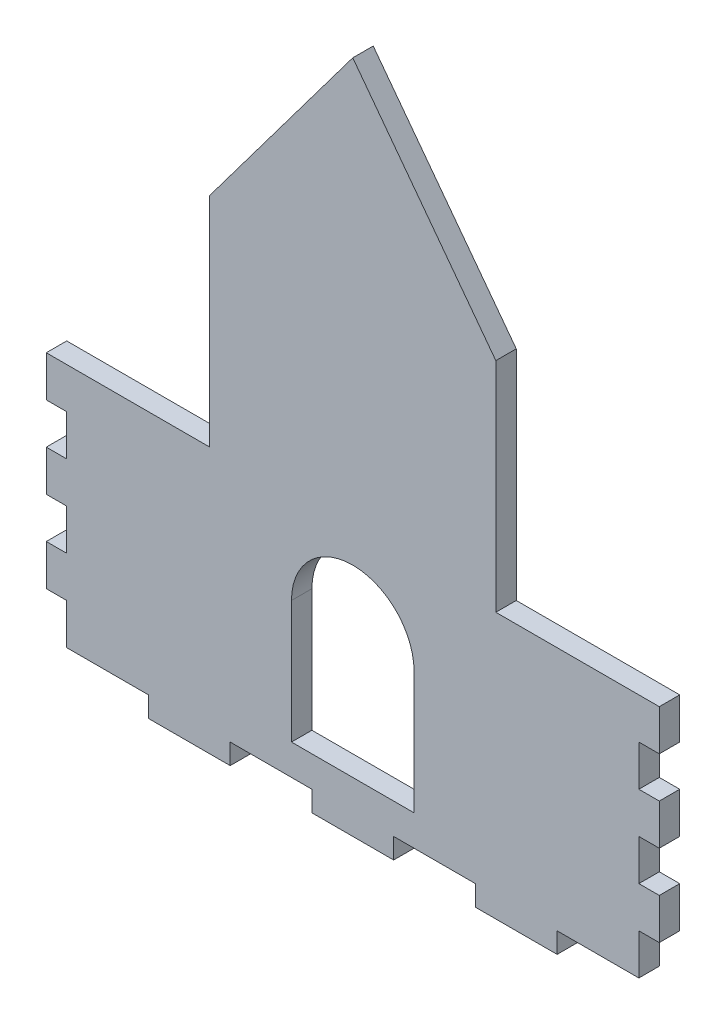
ISO-10303-21;
HEADER;
FILE_DESCRIPTION(('STEP AP214'),'2;1');
FILE_NAME('part.step','',(''),(''),'','','');
FILE_SCHEMA(('AUTOMOTIVE_DESIGN { 1 0 10303 214 1 1 1 1 }'));
ENDSEC;
DATA;
#1=APPLICATION_CONTEXT('core data for automotive mechanical design processes');
#2=APPLICATION_PROTOCOL_DEFINITION('international standard','automotive_design',2000,#1);
#3=PRODUCT_CONTEXT('',#1,'mechanical');
#4=PRODUCT('Part','Part','',(#3));
#5=PRODUCT_RELATED_PRODUCT_CATEGORY('part','',(#4));
#6=PRODUCT_DEFINITION_FORMATION('','',#4);
#7=PRODUCT_DEFINITION_CONTEXT('part definition',#1,'design');
#8=PRODUCT_DEFINITION('design','',#6,#7);
#9=PRODUCT_DEFINITION_SHAPE('','',#8);
#10=(LENGTH_UNIT() NAMED_UNIT(*) SI_UNIT(.MILLI.,.METRE.));
#11=(NAMED_UNIT(*) PLANE_ANGLE_UNIT() SI_UNIT($,.RADIAN.));
#12=(NAMED_UNIT(*) SI_UNIT($,.STERADIAN.) SOLID_ANGLE_UNIT());
#13=UNCERTAINTY_MEASURE_WITH_UNIT(LENGTH_MEASURE(1.E-05),#10,'distance_accuracy_value','');
#14=(GEOMETRIC_REPRESENTATION_CONTEXT(3) GLOBAL_UNCERTAINTY_ASSIGNED_CONTEXT((#13)) GLOBAL_UNIT_ASSIGNED_CONTEXT((#10,
#11,#12)) REPRESENTATION_CONTEXT('',''));
#15=CARTESIAN_POINT('',(0.,0.,0.));
#16=DIRECTION('',(0.,0.,1.));
#17=DIRECTION('',(1.,0.,0.));
#18=AXIS2_PLACEMENT_3D('',#15,#16,#17);
#19=CARTESIAN_POINT('',(175.806307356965,-268.81759320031,12.7));
#20=DIRECTION('',(0.,0.,1.));
#21=DIRECTION('',(1.,0.,0.));
#22=AXIS2_PLACEMENT_3D('',#19,#20,#21);
#23=PLANE('',#22);
#24=DIRECTION('',(0.599972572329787,-0.800020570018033,0.));
#25=VECTOR('',#24,1.);
#26=CARTESIAN_POINT('',(501.180298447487,-24.8045293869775,12.7));
#27=LINE('',#26,#25);
#28=CARTESIAN_POINT('',(177.8,406.4,12.7));
#29=VERTEX_POINT('',#28);
#30=CARTESIAN_POINT('',(266.7,287.8582,12.7));
#31=VERTEX_POINT('',#30);
#32=EDGE_CURVE('E889',#29,#31,#27,.T.);
#33=ORIENTED_EDGE('',*,*,#32,.F.);
#34=DIRECTION('',(0.599972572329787,0.800020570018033,0.));
#35=VECTOR('',#34,1.);
#36=CARTESIAN_POINT('',(-147.015625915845,-26.7184360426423,12.7));
#37=LINE('',#36,#35);
#38=CARTESIAN_POINT('',(88.9,287.8582,12.7));
#39=VERTEX_POINT('',#38);
#40=EDGE_CURVE('E892',#39,#29,#37,.T.);
#41=ORIENTED_EDGE('',*,*,#40,.F.);
#42=DIRECTION('',(0.,1.,0.));
#43=VECTOR('',#42,1.);
#44=CARTESIAN_POINT('',(88.9,-268.81759320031,12.7));
#45=LINE('',#44,#43);
#46=CARTESIAN_POINT('',(88.9,152.4,12.7));
#47=VERTEX_POINT('',#46);
#48=EDGE_CURVE('E893',#47,#39,#45,.T.);
#49=ORIENTED_EDGE('',*,*,#48,.F.);
#50=DIRECTION('',(1.,0.,0.));
#51=VECTOR('',#50,1.);
#52=CARTESIAN_POINT('',(175.806307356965,152.4,12.7));
#53=LINE('',#52,#51);
#54=CARTESIAN_POINT('',(-12.7,152.4,12.7));
#55=VERTEX_POINT('',#54);
#56=EDGE_CURVE('E592',#55,#47,#53,.T.);
#57=ORIENTED_EDGE('',*,*,#56,.F.);
#58=DIRECTION('',(0.,-1.,0.));
#59=VECTOR('',#58,1.);
#60=CARTESIAN_POINT('',(-12.7,-407.170012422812,12.7));
#61=LINE('',#60,#59);
#62=CARTESIAN_POINT('',(-12.7,127.,12.7));
#63=VERTEX_POINT('',#62);
#64=EDGE_CURVE('E550',#55,#63,#61,.T.);
#65=ORIENTED_EDGE('',*,*,#64,.T.);
#66=DIRECTION('',(1.,0.,0.));
#67=VECTOR('',#66,1.);
#68=CARTESIAN_POINT('',(199.891416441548,127.,12.7));
#69=LINE('',#68,#67);
#70=CARTESIAN_POINT('',(0.,127.,12.7));
#71=VERTEX_POINT('',#70);
#72=EDGE_CURVE('E561',#63,#71,#69,.T.);
#73=ORIENTED_EDGE('',*,*,#72,.T.);
#74=DIRECTION('',(0.,1.,0.));
#75=VECTOR('',#74,1.);
#76=CARTESIAN_POINT('',(0.,-268.81759320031,12.7));
#77=LINE('',#76,#75);
#78=CARTESIAN_POINT('',(0.,101.6,12.7));
#79=VERTEX_POINT('',#78);
#80=EDGE_CURVE('E589',#79,#71,#77,.T.);
#81=ORIENTED_EDGE('',*,*,#80,.F.);
#82=DIRECTION('',(1.,0.,0.));
#83=VECTOR('',#82,1.);
#84=CARTESIAN_POINT('',(199.891416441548,101.6,12.7));
#85=LINE('',#84,#83);
#86=CARTESIAN_POINT('',(-12.7,101.6,12.7));
#87=VERTEX_POINT('',#86);
#88=EDGE_CURVE('E524',#87,#79,#85,.T.);
#89=ORIENTED_EDGE('',*,*,#88,.F.);
#90=DIRECTION('',(0.,-1.,0.));
#91=VECTOR('',#90,1.);
#92=CARTESIAN_POINT('',(-12.7,-407.170012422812,12.7));
#93=LINE('',#92,#91);
#94=CARTESIAN_POINT('',(-12.7,76.2,12.7));
#95=VERTEX_POINT('',#94);
#96=EDGE_CURVE('E542',#87,#95,#93,.T.);
#97=ORIENTED_EDGE('',*,*,#96,.T.);
#98=DIRECTION('',(1.,0.,0.));
#99=VECTOR('',#98,1.);
#100=CARTESIAN_POINT('',(199.891416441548,76.2,12.7));
#101=LINE('',#100,#99);
#102=CARTESIAN_POINT('',(0.,76.2,12.7));
#103=VERTEX_POINT('',#102);
#104=EDGE_CURVE('E534',#95,#103,#101,.T.);
#105=ORIENTED_EDGE('',*,*,#104,.T.);
#106=CARTESIAN_POINT('',(0.,50.8,12.7));
#107=VERTEX_POINT('',#106);
#108=EDGE_CURVE('E591',#107,#103,#77,.T.);
#109=ORIENTED_EDGE('',*,*,#108,.F.);
#110=DIRECTION('',(-1.,0.,0.));
#111=VECTOR('',#110,1.);
#112=CARTESIAN_POINT('',(199.891416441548,50.8,12.7));
#113=LINE('',#112,#111);
#114=CARTESIAN_POINT('',(-12.7,50.8,12.7));
#115=VERTEX_POINT('',#114);
#116=EDGE_CURVE('E513',#107,#115,#113,.T.);
#117=ORIENTED_EDGE('',*,*,#116,.T.);
#118=DIRECTION('',(0.,-1.,0.));
#119=VECTOR('',#118,1.);
#120=CARTESIAN_POINT('',(-12.7,-407.170012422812,12.7));
#121=LINE('',#120,#119);
#122=CARTESIAN_POINT('',(-12.7,25.4,12.7));
#123=VERTEX_POINT('',#122);
#124=EDGE_CURVE('E516',#115,#123,#121,.T.);
#125=ORIENTED_EDGE('',*,*,#124,.T.);
#126=DIRECTION('',(-1.,0.,0.));
#127=VECTOR('',#126,1.);
#128=CARTESIAN_POINT('',(199.891416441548,25.4,12.7));
#129=LINE('',#128,#127);
#130=CARTESIAN_POINT('',(0.,25.4,12.7));
#131=VERTEX_POINT('',#130);
#132=EDGE_CURVE('E507',#131,#123,#129,.T.);
#133=ORIENTED_EDGE('',*,*,#132,.F.);
#134=CARTESIAN_POINT('',(0.,0.,12.7));
#135=VERTEX_POINT('',#134);
#136=EDGE_CURVE('E574',#135,#131,#77,.T.);
#137=ORIENTED_EDGE('',*,*,#136,.F.);
#138=DIRECTION('',(1.,0.,0.));
#139=VECTOR('',#138,1.);
#140=CARTESIAN_POINT('',(175.806307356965,0.,12.7));
#141=LINE('',#140,#139);
#142=CARTESIAN_POINT('',(50.8,0.,12.7));
#143=VERTEX_POINT('',#142);
#144=EDGE_CURVE('E482',#135,#143,#141,.T.);
#145=ORIENTED_EDGE('',*,*,#144,.T.);
#146=DIRECTION('',(0.,1.,0.));
#147=VECTOR('',#146,1.);
#148=CARTESIAN_POINT('',(50.8,-12.7,12.7));
#149=LINE('',#148,#147);
#150=CARTESIAN_POINT('',(50.8,-12.7,12.7));
#151=VERTEX_POINT('',#150);
#152=EDGE_CURVE('E792',#151,#143,#149,.T.);
#153=ORIENTED_EDGE('',*,*,#152,.F.);
#154=DIRECTION('',(-1.,0.,0.));
#155=VECTOR('',#154,1.);
#156=CARTESIAN_POINT('',(177.8,-12.7,12.7));
#157=LINE('',#156,#155);
#158=CARTESIAN_POINT('',(101.6,-12.7,12.7));
#159=VERTEX_POINT('',#158);
#160=EDGE_CURVE('E419',#159,#151,#157,.T.);
#161=ORIENTED_EDGE('',*,*,#160,.F.);
#162=DIRECTION('',(0.,1.,0.));
#163=VECTOR('',#162,1.);
#164=CARTESIAN_POINT('',(101.6,-12.7,12.7));
#165=LINE('',#164,#163);
#166=CARTESIAN_POINT('',(101.6,0.,12.7));
#167=VERTEX_POINT('',#166);
#168=EDGE_CURVE('E790',#159,#167,#165,.T.);
#169=ORIENTED_EDGE('',*,*,#168,.T.);
#170=CARTESIAN_POINT('',(152.4,0.,12.7));
#171=VERTEX_POINT('',#170);
#172=EDGE_CURVE('E807',#167,#171,#141,.T.);
#173=ORIENTED_EDGE('',*,*,#172,.T.);
#174=DIRECTION('',(0.,1.,0.));
#175=VECTOR('',#174,1.);
#176=CARTESIAN_POINT('',(152.4,-12.7,12.7));
#177=LINE('',#176,#175);
#178=CARTESIAN_POINT('',(152.4,-12.7,12.7));
#179=VERTEX_POINT('',#178);
#180=EDGE_CURVE('E409',#179,#171,#177,.T.);
#181=ORIENTED_EDGE('',*,*,#180,.F.);
#182=DIRECTION('',(-1.,0.,0.));
#183=VECTOR('',#182,1.);
#184=CARTESIAN_POINT('',(177.8,-12.7,12.7));
#185=LINE('',#184,#183);
#186=CARTESIAN_POINT('',(203.2,-12.7,12.7));
#187=VERTEX_POINT('',#186);
#188=EDGE_CURVE('E392',#187,#179,#185,.T.);
#189=ORIENTED_EDGE('',*,*,#188,.F.);
#190=DIRECTION('',(0.,1.,0.));
#191=VECTOR('',#190,1.);
#192=CARTESIAN_POINT('',(203.2,-12.7,12.7));
#193=LINE('',#192,#191);
#194=CARTESIAN_POINT('',(203.2,0.,12.7));
#195=VERTEX_POINT('',#194);
#196=EDGE_CURVE('E412',#187,#195,#193,.T.);
#197=ORIENTED_EDGE('',*,*,#196,.T.);
#198=CARTESIAN_POINT('',(254.,0.,12.7));
#199=VERTEX_POINT('',#198);
#200=EDGE_CURVE('E446',#195,#199,#141,.T.);
#201=ORIENTED_EDGE('',*,*,#200,.T.);
#202=DIRECTION('',(0.,1.,0.));
#203=VECTOR('',#202,1.);
#204=CARTESIAN_POINT('',(254.,-12.7,12.7));
#205=LINE('',#204,#203);
#206=CARTESIAN_POINT('',(254.,-12.7,12.7));
#207=VERTEX_POINT('',#206);
#208=EDGE_CURVE('E385',#207,#199,#205,.T.);
#209=ORIENTED_EDGE('',*,*,#208,.F.);
#210=DIRECTION('',(-1.,0.,0.));
#211=VECTOR('',#210,1.);
#212=CARTESIAN_POINT('',(177.8,-12.7,12.7));
#213=LINE('',#212,#211);
#214=CARTESIAN_POINT('',(304.8,-12.7,12.7));
#215=VERTEX_POINT('',#214);
#216=EDGE_CURVE('E361',#215,#207,#213,.T.);
#217=ORIENTED_EDGE('',*,*,#216,.F.);
#218=DIRECTION('',(0.,1.,0.));
#219=VECTOR('',#218,1.);
#220=CARTESIAN_POINT('',(304.8,-12.7,12.7));
#221=LINE('',#220,#219);
#222=CARTESIAN_POINT('',(304.8,0.,12.7));
#223=VERTEX_POINT('',#222);
#224=EDGE_CURVE('E372',#215,#223,#221,.T.);
#225=ORIENTED_EDGE('',*,*,#224,.T.);
#226=CARTESIAN_POINT('',(355.6,0.,12.7));
#227=VERTEX_POINT('',#226);
#228=EDGE_CURVE('E39',#223,#227,#141,.T.);
#229=ORIENTED_EDGE('',*,*,#228,.T.);
#230=DIRECTION('',(0.,1.,0.));
#231=VECTOR('',#230,1.);
#232=CARTESIAN_POINT('',(355.6,-268.81759320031,12.7));
#233=LINE('',#232,#231);
#234=CARTESIAN_POINT('',(355.6,25.4,12.7));
#235=VERTEX_POINT('',#234);
#236=EDGE_CURVE('E466',#227,#235,#233,.T.);
#237=ORIENTED_EDGE('',*,*,#236,.T.);
#238=DIRECTION('',(-1.,0.,0.));
#239=VECTOR('',#238,1.);
#240=CARTESIAN_POINT('',(199.891416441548,25.4,12.7));
#241=LINE('',#240,#239);
#242=CARTESIAN_POINT('',(368.3,25.4,12.7));
#243=VERTEX_POINT('',#242);
#244=EDGE_CURVE('E762',#243,#235,#241,.T.);
#245=ORIENTED_EDGE('',*,*,#244,.F.);
#246=DIRECTION('',(0.,-1.,0.));
#247=VECTOR('',#246,1.);
#248=CARTESIAN_POINT('',(368.3,-407.170012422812,12.7));
#249=LINE('',#248,#247);
#250=CARTESIAN_POINT('',(368.3,50.8,12.7));
#251=VERTEX_POINT('',#250);
#252=EDGE_CURVE('E777',#251,#243,#249,.T.);
#253=ORIENTED_EDGE('',*,*,#252,.F.);
#254=DIRECTION('',(-1.,0.,0.));
#255=VECTOR('',#254,1.);
#256=CARTESIAN_POINT('',(199.891416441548,50.8,12.7));
#257=LINE('',#256,#255);
#258=CARTESIAN_POINT('',(355.6,50.8,12.7));
#259=VERTEX_POINT('',#258);
#260=EDGE_CURVE('E772',#251,#259,#257,.T.);
#261=ORIENTED_EDGE('',*,*,#260,.T.);
#262=CARTESIAN_POINT('',(355.6,76.1999999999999,12.7));
#263=VERTEX_POINT('',#262);
#264=EDGE_CURVE('E463',#259,#263,#233,.T.);
#265=ORIENTED_EDGE('',*,*,#264,.T.);
#266=DIRECTION('',(1.,0.,0.));
#267=VECTOR('',#266,1.);
#268=CARTESIAN_POINT('',(199.891416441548,76.2,12.7));
#269=LINE('',#268,#267);
#270=CARTESIAN_POINT('',(368.3,76.2,12.7));
#271=VERTEX_POINT('',#270);
#272=EDGE_CURVE('E624',#263,#271,#269,.T.);
#273=ORIENTED_EDGE('',*,*,#272,.T.);
#274=DIRECTION('',(0.,-1.,0.));
#275=VECTOR('',#274,1.);
#276=CARTESIAN_POINT('',(368.3,-407.170012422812,12.7));
#277=LINE('',#276,#275);
#278=CARTESIAN_POINT('',(368.3,101.6,12.7));
#279=VERTEX_POINT('',#278);
#280=EDGE_CURVE('E640',#279,#271,#277,.T.);
#281=ORIENTED_EDGE('',*,*,#280,.F.);
#282=DIRECTION('',(1.,0.,0.));
#283=VECTOR('',#282,1.);
#284=CARTESIAN_POINT('',(199.891416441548,101.6,12.7));
#285=LINE('',#284,#283);
#286=CARTESIAN_POINT('',(355.6,101.6,12.7));
#287=VERTEX_POINT('',#286);
#288=EDGE_CURVE('E643',#287,#279,#285,.T.);
#289=ORIENTED_EDGE('',*,*,#288,.F.);
#290=CARTESIAN_POINT('',(355.6,127.,12.7));
#291=VERTEX_POINT('',#290);
#292=EDGE_CURVE('E467',#287,#291,#233,.T.);
#293=ORIENTED_EDGE('',*,*,#292,.T.);
#294=DIRECTION('',(1.,0.,0.));
#295=VECTOR('',#294,1.);
#296=CARTESIAN_POINT('',(199.891416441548,127.,12.7));
#297=LINE('',#296,#295);
#298=CARTESIAN_POINT('',(368.3,127.,12.7));
#299=VERTEX_POINT('',#298);
#300=EDGE_CURVE('E651',#291,#299,#297,.T.);
#301=ORIENTED_EDGE('',*,*,#300,.T.);
#302=DIRECTION('',(0.,-1.,0.));
#303=VECTOR('',#302,1.);
#304=CARTESIAN_POINT('',(368.3,-407.170012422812,12.7));
#305=LINE('',#304,#303);
#306=CARTESIAN_POINT('',(368.3,152.4,12.7));
#307=VERTEX_POINT('',#306);
#308=EDGE_CURVE('E647',#307,#299,#305,.T.);
#309=ORIENTED_EDGE('',*,*,#308,.F.);
#310=DIRECTION('',(1.,0.,0.));
#311=VECTOR('',#310,1.);
#312=CARTESIAN_POINT('',(175.806307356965,152.4,12.7));
#313=LINE('',#312,#311);
#314=CARTESIAN_POINT('',(266.7,152.4,12.7));
#315=VERTEX_POINT('',#314);
#316=EDGE_CURVE('E474',#315,#307,#313,.T.);
#317=ORIENTED_EDGE('',*,*,#316,.F.);
#318=DIRECTION('',(0.,1.,0.));
#319=VECTOR('',#318,1.);
#320=CARTESIAN_POINT('',(266.7,-268.81759320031,12.7));
#321=LINE('',#320,#319);
#322=EDGE_CURVE('E752',#315,#31,#321,.T.);
#323=ORIENTED_EDGE('',*,*,#322,.T.);
#324=EDGE_LOOP('',(#33,#41,#49,#57,#65,#73,#81,#89,#97,#105,#109,#117,#125,#133,#137,#145,#153,
#161,#169,#173,#181,#189,#197,#201,#209,#217,#225,#229,#237,#245,#253,#261,#265,#273,#281,#289,
#293,#301,#309,#317,#323));
#325=FACE_BOUND('',#324,.T.);
#326=DIRECTION('',(-1.,0.,0.));
#327=VECTOR('',#326,1.);
#328=CARTESIAN_POINT('',(216.218292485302,19.05,12.7));
#329=LINE('',#328,#327);
#330=CARTESIAN_POINT('',(215.9,19.05,12.7));
#331=VERTEX_POINT('',#330);
#332=CARTESIAN_POINT('',(139.7,19.05,12.7));
#333=VERTEX_POINT('',#332);
#334=EDGE_CURVE('E351',#331,#333,#329,.T.);
#335=ORIENTED_EDGE('',*,*,#334,.T.);
#336=DIRECTION('',(0.,1.,0.));
#337=VECTOR('',#336,1.);
#338=CARTESIAN_POINT('',(139.7,-363.366298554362,12.7));
#339=LINE('',#338,#337);
#340=CARTESIAN_POINT('',(139.7,95.25,12.7));
#341=VERTEX_POINT('',#340);
#342=EDGE_CURVE('E53',#333,#341,#339,.T.);
#343=ORIENTED_EDGE('',*,*,#342,.T.);
#344=CARTESIAN_POINT('',(177.8,95.25,12.7));
#345=DIRECTION('',(0.,0.,1.));
#346=DIRECTION('',(1.,0.,0.));
#347=AXIS2_PLACEMENT_3D('',#344,#345,#346);
#348=CIRCLE('',#347,38.1);
#349=CARTESIAN_POINT('',(215.9,95.25,12.7));
#350=VERTEX_POINT('',#349);
#351=EDGE_CURVE('E342',#341,#350,#348,.F.);
#352=ORIENTED_EDGE('',*,*,#351,.T.);
#353=DIRECTION('',(0.,1.,0.));
#354=VECTOR('',#353,1.);
#355=CARTESIAN_POINT('',(215.9,-363.366298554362,12.7));
#356=LINE('',#355,#354);
#357=EDGE_CURVE('E345',#331,#350,#356,.T.);
#358=ORIENTED_EDGE('',*,*,#357,.F.);
#359=EDGE_LOOP('',(#335,#343,#352,#358));
#360=FACE_BOUND('',#359,.T.);
#361=ADVANCED_FACE('F35',(#325,#360),#23,.T.);
#362=CARTESIAN_POINT('',(175.806307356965,-268.81759320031,0.));
#363=DIRECTION('',(0.,0.,1.));
#364=DIRECTION('',(1.,0.,0.));
#365=AXIS2_PLACEMENT_3D('',#362,#363,#364);
#366=PLANE('',#365);
#367=DIRECTION('',(0.599972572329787,-0.800020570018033,0.));
#368=VECTOR('',#367,1.);
#369=CARTESIAN_POINT('',(501.180298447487,-24.8045293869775,0.));
#370=LINE('',#369,#368);
#371=CARTESIAN_POINT('',(177.8,406.4,0.));
#372=VERTEX_POINT('',#371);
#373=CARTESIAN_POINT('',(266.7,287.8582,0.));
#374=VERTEX_POINT('',#373);
#375=EDGE_CURVE('E573',#372,#374,#370,.T.);
#376=ORIENTED_EDGE('',*,*,#375,.T.);
#377=DIRECTION('',(0.,1.,0.));
#378=VECTOR('',#377,1.);
#379=CARTESIAN_POINT('',(266.7,-268.81759320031,0.));
#380=LINE('',#379,#378);
#381=CARTESIAN_POINT('',(266.7,152.4,0.));
#382=VERTEX_POINT('',#381);
#383=EDGE_CURVE('E605',#382,#374,#380,.T.);
#384=ORIENTED_EDGE('',*,*,#383,.F.);
#385=DIRECTION('',(1.,0.,0.));
#386=VECTOR('',#385,1.);
#387=CARTESIAN_POINT('',(175.806307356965,152.4,0.));
#388=LINE('',#387,#386);
#389=CARTESIAN_POINT('',(368.3,152.4,0.));
#390=VERTEX_POINT('',#389);
#391=EDGE_CURVE('E600',#382,#390,#388,.T.);
#392=ORIENTED_EDGE('',*,*,#391,.T.);
#393=DIRECTION('',(0.,-1.,0.));
#394=VECTOR('',#393,1.);
#395=CARTESIAN_POINT('',(368.3,-407.170012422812,0.));
#396=LINE('',#395,#394);
#397=CARTESIAN_POINT('',(368.3,127.,0.));
#398=VERTEX_POINT('',#397);
#399=EDGE_CURVE('E490',#390,#398,#396,.T.);
#400=ORIENTED_EDGE('',*,*,#399,.T.);
#401=DIRECTION('',(1.,0.,0.));
#402=VECTOR('',#401,1.);
#403=CARTESIAN_POINT('',(199.891416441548,127.,0.));
#404=LINE('',#403,#402);
#405=CARTESIAN_POINT('',(355.6,127.,0.));
#406=VERTEX_POINT('',#405);
#407=EDGE_CURVE('E486',#406,#398,#404,.T.);
#408=ORIENTED_EDGE('',*,*,#407,.F.);
#409=DIRECTION('',(0.,1.,0.));
#410=VECTOR('',#409,1.);
#411=CARTESIAN_POINT('',(355.6,-268.81759320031,0.));
#412=LINE('',#411,#410);
#413=CARTESIAN_POINT('',(355.6,101.6,0.));
#414=VERTEX_POINT('',#413);
#415=EDGE_CURVE('E462',#414,#406,#412,.T.);
#416=ORIENTED_EDGE('',*,*,#415,.F.);
#417=DIRECTION('',(1.,0.,0.));
#418=VECTOR('',#417,1.);
#419=CARTESIAN_POINT('',(199.891416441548,101.6,0.));
#420=LINE('',#419,#418);
#421=CARTESIAN_POINT('',(368.3,101.6,0.));
#422=VERTEX_POINT('',#421);
#423=EDGE_CURVE('E633',#414,#422,#420,.T.);
#424=ORIENTED_EDGE('',*,*,#423,.T.);
#425=DIRECTION('',(0.,-1.,0.));
#426=VECTOR('',#425,1.);
#427=CARTESIAN_POINT('',(368.3,-407.170012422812,0.));
#428=LINE('',#427,#426);
#429=CARTESIAN_POINT('',(368.3,76.2,0.));
#430=VERTEX_POINT('',#429);
#431=EDGE_CURVE('E630',#422,#430,#428,.T.);
#432=ORIENTED_EDGE('',*,*,#431,.T.);
#433=DIRECTION('',(1.,0.,0.));
#434=VECTOR('',#433,1.);
#435=CARTESIAN_POINT('',(199.891416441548,76.2,0.));
#436=LINE('',#435,#434);
#437=CARTESIAN_POINT('',(355.6,76.1999999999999,0.));
#438=VERTEX_POINT('',#437);
#439=EDGE_CURVE('E622',#438,#430,#436,.T.);
#440=ORIENTED_EDGE('',*,*,#439,.F.);
#441=CARTESIAN_POINT('',(355.6,50.8,0.));
#442=VERTEX_POINT('',#441);
#443=EDGE_CURVE('E468',#442,#438,#412,.T.);
#444=ORIENTED_EDGE('',*,*,#443,.F.);
#445=DIRECTION('',(-1.,0.,0.));
#446=VECTOR('',#445,1.);
#447=CARTESIAN_POINT('',(199.891416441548,50.8,0.));
#448=LINE('',#447,#446);
#449=CARTESIAN_POINT('',(368.3,50.8,0.));
#450=VERTEX_POINT('',#449);
#451=EDGE_CURVE('E775',#450,#442,#448,.T.);
#452=ORIENTED_EDGE('',*,*,#451,.F.);
#453=DIRECTION('',(0.,-1.,0.));
#454=VECTOR('',#453,1.);
#455=CARTESIAN_POINT('',(368.3,-407.170012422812,0.));
#456=LINE('',#455,#454);
#457=CARTESIAN_POINT('',(368.3,25.4,0.));
#458=VERTEX_POINT('',#457);
#459=EDGE_CURVE('E771',#450,#458,#456,.T.);
#460=ORIENTED_EDGE('',*,*,#459,.T.);
#461=DIRECTION('',(-1.,0.,0.));
#462=VECTOR('',#461,1.);
#463=CARTESIAN_POINT('',(199.891416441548,25.4,0.));
#464=LINE('',#463,#462);
#465=CARTESIAN_POINT('',(355.6,25.4,0.));
#466=VERTEX_POINT('',#465);
#467=EDGE_CURVE('E785',#458,#466,#464,.T.);
#468=ORIENTED_EDGE('',*,*,#467,.T.);
#469=CARTESIAN_POINT('',(355.6,0.,0.));
#470=VERTEX_POINT('',#469);
#471=EDGE_CURVE('E599',#470,#466,#412,.T.);
#472=ORIENTED_EDGE('',*,*,#471,.F.);
#473=DIRECTION('',(1.,0.,0.));
#474=VECTOR('',#473,1.);
#475=CARTESIAN_POINT('',(175.806307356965,0.,0.));
#476=LINE('',#475,#474);
#477=CARTESIAN_POINT('',(304.8,0.,0.));
#478=VERTEX_POINT('',#477);
#479=EDGE_CURVE('E445',#478,#470,#476,.T.);
#480=ORIENTED_EDGE('',*,*,#479,.F.);
#481=DIRECTION('',(0.,1.,0.));
#482=VECTOR('',#481,1.);
#483=CARTESIAN_POINT('',(304.8,-12.7,0.));
#484=LINE('',#483,#482);
#485=CARTESIAN_POINT('',(304.8,-12.7,0.));
#486=VERTEX_POINT('',#485);
#487=EDGE_CURVE('E379',#486,#478,#484,.T.);
#488=ORIENTED_EDGE('',*,*,#487,.F.);
#489=DIRECTION('',(1.,0.,0.));
#490=VECTOR('',#489,1.);
#491=CARTESIAN_POINT('',(177.8,-12.7,0.));
#492=LINE('',#491,#490);
#493=CARTESIAN_POINT('',(254.,-12.7,0.));
#494=VERTEX_POINT('',#493);
#495=EDGE_CURVE('E367',#494,#486,#492,.T.);
#496=ORIENTED_EDGE('',*,*,#495,.F.);
#497=DIRECTION('',(0.,1.,0.));
#498=VECTOR('',#497,1.);
#499=CARTESIAN_POINT('',(254.,-12.7,0.));
#500=LINE('',#499,#498);
#501=CARTESIAN_POINT('',(254.,0.,0.));
#502=VERTEX_POINT('',#501);
#503=EDGE_CURVE('E382',#494,#502,#500,.T.);
#504=ORIENTED_EDGE('',*,*,#503,.T.);
#505=CARTESIAN_POINT('',(203.2,0.,0.));
#506=VERTEX_POINT('',#505);
#507=EDGE_CURVE('E441',#506,#502,#476,.T.);
#508=ORIENTED_EDGE('',*,*,#507,.F.);
#509=DIRECTION('',(0.,1.,0.));
#510=VECTOR('',#509,1.);
#511=CARTESIAN_POINT('',(203.2,-12.7,0.));
#512=LINE('',#511,#510);
#513=CARTESIAN_POINT('',(203.2,-12.7,0.));
#514=VERTEX_POINT('',#513);
#515=EDGE_CURVE('E399',#514,#506,#512,.T.);
#516=ORIENTED_EDGE('',*,*,#515,.F.);
#517=DIRECTION('',(1.,0.,0.));
#518=VECTOR('',#517,1.);
#519=CARTESIAN_POINT('',(177.8,-12.7,0.));
#520=LINE('',#519,#518);
#521=CARTESIAN_POINT('',(152.4,-12.7,0.));
#522=VERTEX_POINT('',#521);
#523=EDGE_CURVE('E397',#522,#514,#520,.T.);
#524=ORIENTED_EDGE('',*,*,#523,.F.);
#525=DIRECTION('',(0.,1.,0.));
#526=VECTOR('',#525,1.);
#527=CARTESIAN_POINT('',(152.4,-12.7,0.));
#528=LINE('',#527,#526);
#529=CARTESIAN_POINT('',(152.4,0.,0.));
#530=VERTEX_POINT('',#529);
#531=EDGE_CURVE('E406',#522,#530,#528,.T.);
#532=ORIENTED_EDGE('',*,*,#531,.T.);
#533=CARTESIAN_POINT('',(101.6,0.,0.));
#534=VERTEX_POINT('',#533);
#535=EDGE_CURVE('E444',#534,#530,#476,.T.);
#536=ORIENTED_EDGE('',*,*,#535,.F.);
#537=DIRECTION('',(0.,1.,0.));
#538=VECTOR('',#537,1.);
#539=CARTESIAN_POINT('',(101.6,-12.7,0.));
#540=LINE('',#539,#538);
#541=CARTESIAN_POINT('',(101.6,-12.7,0.));
#542=VERTEX_POINT('',#541);
#543=EDGE_CURVE('E426',#542,#534,#540,.T.);
#544=ORIENTED_EDGE('',*,*,#543,.F.);
#545=DIRECTION('',(1.,0.,0.));
#546=VECTOR('',#545,1.);
#547=CARTESIAN_POINT('',(177.8,-12.7,0.));
#548=LINE('',#547,#546);
#549=CARTESIAN_POINT('',(50.8,-12.7,0.));
#550=VERTEX_POINT('',#549);
#551=EDGE_CURVE('E424',#550,#542,#548,.T.);
#552=ORIENTED_EDGE('',*,*,#551,.F.);
#553=DIRECTION('',(0.,1.,0.));
#554=VECTOR('',#553,1.);
#555=CARTESIAN_POINT('',(50.8,-12.7,0.));
#556=LINE('',#555,#554);
#557=CARTESIAN_POINT('',(50.8,0.,0.));
#558=VERTEX_POINT('',#557);
#559=EDGE_CURVE('E438',#550,#558,#556,.T.);
#560=ORIENTED_EDGE('',*,*,#559,.T.);
#561=CARTESIAN_POINT('',(0.,0.,0.));
#562=VERTEX_POINT('',#561);
#563=EDGE_CURVE('E460',#562,#558,#476,.T.);
#564=ORIENTED_EDGE('',*,*,#563,.F.);
#565=DIRECTION('',(0.,1.,0.));
#566=VECTOR('',#565,1.);
#567=CARTESIAN_POINT('',(0.,-268.81759320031,0.));
#568=LINE('',#567,#566);
#569=CARTESIAN_POINT('',(0.,25.4,0.));
#570=VERTEX_POINT('',#569);
#571=EDGE_CURVE('E851',#562,#570,#568,.T.);
#572=ORIENTED_EDGE('',*,*,#571,.T.);
#573=DIRECTION('',(-1.,0.,0.));
#574=VECTOR('',#573,1.);
#575=CARTESIAN_POINT('',(199.891416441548,25.4,0.));
#576=LINE('',#575,#574);
#577=CARTESIAN_POINT('',(-12.7,25.4,0.));
#578=VERTEX_POINT('',#577);
#579=EDGE_CURVE('E510',#570,#578,#576,.T.);
#580=ORIENTED_EDGE('',*,*,#579,.T.);
#581=DIRECTION('',(0.,-1.,0.));
#582=VECTOR('',#581,1.);
#583=CARTESIAN_POINT('',(-12.7,-407.170012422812,0.));
#584=LINE('',#583,#582);
#585=CARTESIAN_POINT('',(-12.7,50.8,0.));
#586=VERTEX_POINT('',#585);
#587=EDGE_CURVE('E506',#586,#578,#584,.T.);
#588=ORIENTED_EDGE('',*,*,#587,.F.);
#589=DIRECTION('',(-1.,0.,0.));
#590=VECTOR('',#589,1.);
#591=CARTESIAN_POINT('',(199.891416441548,50.8,0.));
#592=LINE('',#591,#590);
#593=CARTESIAN_POINT('',(0.,50.8,0.));
#594=VERTEX_POINT('',#593);
#595=EDGE_CURVE('E503',#594,#586,#592,.T.);
#596=ORIENTED_EDGE('',*,*,#595,.F.);
#597=CARTESIAN_POINT('',(0.,76.2,0.));
#598=VERTEX_POINT('',#597);
#599=EDGE_CURVE('E587',#594,#598,#568,.T.);
#600=ORIENTED_EDGE('',*,*,#599,.T.);
#601=DIRECTION('',(1.,0.,0.));
#602=VECTOR('',#601,1.);
#603=CARTESIAN_POINT('',(199.891416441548,76.2,0.));
#604=LINE('',#603,#602);
#605=CARTESIAN_POINT('',(-12.7,76.2,0.));
#606=VERTEX_POINT('',#605);
#607=EDGE_CURVE('E537',#606,#598,#604,.T.);
#608=ORIENTED_EDGE('',*,*,#607,.F.);
#609=DIRECTION('',(0.,-1.,0.));
#610=VECTOR('',#609,1.);
#611=CARTESIAN_POINT('',(-12.7,-407.170012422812,0.));
#612=LINE('',#611,#610);
#613=CARTESIAN_POINT('',(-12.7,101.6,0.));
#614=VERTEX_POINT('',#613);
#615=EDGE_CURVE('E533',#614,#606,#612,.T.);
#616=ORIENTED_EDGE('',*,*,#615,.F.);
#617=DIRECTION('',(1.,0.,0.));
#618=VECTOR('',#617,1.);
#619=CARTESIAN_POINT('',(199.891416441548,101.6,0.));
#620=LINE('',#619,#618);
#621=CARTESIAN_POINT('',(0.,101.6,0.));
#622=VERTEX_POINT('',#621);
#623=EDGE_CURVE('E530',#614,#622,#620,.T.);
#624=ORIENTED_EDGE('',*,*,#623,.T.);
#625=CARTESIAN_POINT('',(0.,127.,0.));
#626=VERTEX_POINT('',#625);
#627=EDGE_CURVE('E585',#622,#626,#568,.T.);
#628=ORIENTED_EDGE('',*,*,#627,.T.);
#629=DIRECTION('',(1.,0.,0.));
#630=VECTOR('',#629,1.);
#631=CARTESIAN_POINT('',(199.891416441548,127.,0.));
#632=LINE('',#631,#630);
#633=CARTESIAN_POINT('',(-12.7,127.,0.));
#634=VERTEX_POINT('',#633);
#635=EDGE_CURVE('E560',#634,#626,#632,.T.);
#636=ORIENTED_EDGE('',*,*,#635,.F.);
#637=DIRECTION('',(0.,-1.,0.));
#638=VECTOR('',#637,1.);
#639=CARTESIAN_POINT('',(-12.7,-407.170012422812,0.));
#640=LINE('',#639,#638);
#641=CARTESIAN_POINT('',(-12.7,152.4,0.));
#642=VERTEX_POINT('',#641);
#643=EDGE_CURVE('E557',#642,#634,#640,.T.);
#644=ORIENTED_EDGE('',*,*,#643,.F.);
#645=DIRECTION('',(1.,0.,0.));
#646=VECTOR('',#645,1.);
#647=CARTESIAN_POINT('',(175.806307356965,152.4,0.));
#648=LINE('',#647,#646);
#649=CARTESIAN_POINT('',(88.9,152.4,0.));
#650=VERTEX_POINT('',#649);
#651=EDGE_CURVE('E588',#642,#650,#648,.T.);
#652=ORIENTED_EDGE('',*,*,#651,.T.);
#653=DIRECTION('',(0.,1.,0.));
#654=VECTOR('',#653,1.);
#655=CARTESIAN_POINT('',(88.9,-268.81759320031,0.));
#656=LINE('',#655,#654);
#657=CARTESIAN_POINT('',(88.9,287.8582,0.));
#658=VERTEX_POINT('',#657);
#659=EDGE_CURVE('E745',#650,#658,#656,.T.);
#660=ORIENTED_EDGE('',*,*,#659,.T.);
#661=DIRECTION('',(0.599972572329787,0.800020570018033,0.));
#662=VECTOR('',#661,1.);
#663=CARTESIAN_POINT('',(-147.015625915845,-26.7184360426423,0.));
#664=LINE('',#663,#662);
#665=EDGE_CURVE('E740',#658,#372,#664,.T.);
#666=ORIENTED_EDGE('',*,*,#665,.T.);
#667=EDGE_LOOP('',(#376,#384,#392,#400,#408,#416,#424,#432,#440,#444,#452,#460,#468,#472,#480,
#488,#496,#504,#508,#516,#524,#532,#536,#544,#552,#560,#564,#572,#580,#588,#596,#600,#608,#616,
#624,#628,#636,#644,#652,#660,#666));
#668=FACE_BOUND('',#667,.T.);
#669=DIRECTION('',(0.,1.,0.));
#670=VECTOR('',#669,1.);
#671=CARTESIAN_POINT('',(139.7,-363.366298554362,0.));
#672=LINE('',#671,#670);
#673=CARTESIAN_POINT('',(139.7,19.05,0.));
#674=VERTEX_POINT('',#673);
#675=CARTESIAN_POINT('',(139.7,95.25,0.));
#676=VERTEX_POINT('',#675);
#677=EDGE_CURVE('E334',#674,#676,#672,.T.);
#678=ORIENTED_EDGE('',*,*,#677,.F.);
#679=DIRECTION('',(-1.,0.,0.));
#680=VECTOR('',#679,1.);
#681=CARTESIAN_POINT('',(216.218292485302,19.05,0.));
#682=LINE('',#681,#680);
#683=CARTESIAN_POINT('',(215.9,19.05,0.));
#684=VERTEX_POINT('',#683);
#685=EDGE_CURVE('E326',#684,#674,#682,.T.);
#686=ORIENTED_EDGE('',*,*,#685,.F.);
#687=DIRECTION('',(0.,1.,0.));
#688=VECTOR('',#687,1.);
#689=CARTESIAN_POINT('',(215.9,-363.366298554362,0.));
#690=LINE('',#689,#688);
#691=CARTESIAN_POINT('',(215.9,95.25,0.));
#692=VERTEX_POINT('',#691);
#693=EDGE_CURVE('E61',#684,#692,#690,.T.);
#694=ORIENTED_EDGE('',*,*,#693,.T.);
#695=CARTESIAN_POINT('',(177.8,95.25,0.));
#696=DIRECTION('',(0.,0.,1.));
#697=DIRECTION('',(1.,0.,0.));
#698=AXIS2_PLACEMENT_3D('',#695,#696,#697);
#699=CIRCLE('',#698,38.1);
#700=EDGE_CURVE('E338',#676,#692,#699,.F.);
#701=ORIENTED_EDGE('',*,*,#700,.F.);
#702=EDGE_LOOP('',(#678,#686,#694,#701));
#703=FACE_BOUND('',#702,.T.);
#704=ADVANCED_FACE('F341',(#668,#703),#366,.F.);
#705=CARTESIAN_POINT('',(175.806307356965,0.,12.7));
#706=DIRECTION('',(0.,1.,0.));
#707=DIRECTION('',(0.,0.,1.));
#708=AXIS2_PLACEMENT_3D('',#705,#706,#707);
#709=PLANE('',#708);
#710=DIRECTION('',(0.,0.,-1.));
#711=VECTOR('',#710,1.);
#712=CARTESIAN_POINT('',(254.,0.,-270.559651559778));
#713=LINE('',#712,#711);
#714=EDGE_CURVE('E357',#199,#502,#713,.T.);
#715=ORIENTED_EDGE('',*,*,#714,.F.);
#716=ORIENTED_EDGE('',*,*,#200,.F.);
#717=DIRECTION('',(0.,0.,-1.));
#718=VECTOR('',#717,1.);
#719=CARTESIAN_POINT('',(203.2,0.,-270.559651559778));
#720=LINE('',#719,#718);
#721=EDGE_CURVE('E388',#195,#506,#720,.T.);
#722=ORIENTED_EDGE('',*,*,#721,.T.);
#723=ORIENTED_EDGE('',*,*,#507,.T.);
#724=EDGE_LOOP('',(#715,#716,#722,#723));
#725=FACE_BOUND('',#724,.T.);
#726=ADVANCED_FACE('F695',(#725),#709,.F.);
#727=DIRECTION('',(0.,0.,-1.));
#728=VECTOR('',#727,1.);
#729=CARTESIAN_POINT('',(152.4,0.,-270.559651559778));
#730=LINE('',#729,#728);
#731=EDGE_CURVE('E393',#171,#530,#730,.T.);
#732=ORIENTED_EDGE('',*,*,#731,.F.);
#733=ORIENTED_EDGE('',*,*,#172,.F.);
#734=DIRECTION('',(0.,0.,-1.));
#735=VECTOR('',#734,1.);
#736=CARTESIAN_POINT('',(101.6,0.,-270.559651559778));
#737=LINE('',#736,#735);
#738=EDGE_CURVE('E415',#167,#534,#737,.T.);
#739=ORIENTED_EDGE('',*,*,#738,.T.);
#740=ORIENTED_EDGE('',*,*,#535,.T.);
#741=EDGE_LOOP('',(#732,#733,#739,#740));
#742=FACE_BOUND('',#741,.T.);
#743=ADVANCED_FACE('F828',(#742),#709,.F.);
#744=DIRECTION('',(0.,0.,-1.));
#745=VECTOR('',#744,1.);
#746=CARTESIAN_POINT('',(50.8,0.,-270.559651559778));
#747=LINE('',#746,#745);
#748=EDGE_CURVE('E420',#143,#558,#747,.T.);
#749=ORIENTED_EDGE('',*,*,#748,.F.);
#750=ORIENTED_EDGE('',*,*,#144,.F.);
#751=DIRECTION('',(0.,0.,-1.));
#752=VECTOR('',#751,1.);
#753=CARTESIAN_POINT('',(0.,0.,12.7));
#754=LINE('',#753,#752);
#755=EDGE_CURVE('E850',#135,#562,#754,.T.);
#756=ORIENTED_EDGE('',*,*,#755,.T.);
#757=ORIENTED_EDGE('',*,*,#563,.T.);
#758=EDGE_LOOP('',(#749,#750,#756,#757));
#759=FACE_BOUND('',#758,.T.);
#760=ADVANCED_FACE('F718',(#759),#709,.F.);
#761=CARTESIAN_POINT('',(355.6,-268.81759320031,12.7));
#762=DIRECTION('',(-1.,0.,0.));
#763=DIRECTION('',(0.,-1.,0.));
#764=AXIS2_PLACEMENT_3D('',#761,#762,#763);
#765=PLANE('',#764);
#766=DIRECTION('',(0.,0.,1.));
#767=VECTOR('',#766,1.);
#768=CARTESIAN_POINT('',(355.6,25.4,0.));
#769=LINE('',#768,#767);
#770=EDGE_CURVE('E768',#466,#235,#769,.T.);
#771=ORIENTED_EDGE('',*,*,#770,.T.);
#772=ORIENTED_EDGE('',*,*,#236,.F.);
#773=DIRECTION('',(0.,0.,-1.));
#774=VECTOR('',#773,1.);
#775=CARTESIAN_POINT('',(355.6,0.,12.7));
#776=LINE('',#775,#774);
#777=EDGE_CURVE('E854',#227,#470,#776,.T.);
#778=ORIENTED_EDGE('',*,*,#777,.T.);
#779=ORIENTED_EDGE('',*,*,#471,.T.);
#780=EDGE_LOOP('',(#771,#772,#778,#779));
#781=FACE_BOUND('',#780,.T.);
#782=ADVANCED_FACE('F713',(#781),#765,.F.);
#783=DIRECTION('',(0.,0.,1.));
#784=VECTOR('',#783,1.);
#785=CARTESIAN_POINT('',(355.6,101.6,0.));
#786=LINE('',#785,#784);
#787=EDGE_CURVE('E626',#414,#287,#786,.T.);
#788=ORIENTED_EDGE('',*,*,#787,.F.);
#789=ORIENTED_EDGE('',*,*,#415,.T.);
#790=DIRECTION('',(0.,0.,1.));
#791=VECTOR('',#790,1.);
#792=CARTESIAN_POINT('',(355.6,127.,0.));
#793=LINE('',#792,#791);
#794=EDGE_CURVE('E491',#406,#291,#793,.T.);
#795=ORIENTED_EDGE('',*,*,#794,.T.);
#796=ORIENTED_EDGE('',*,*,#292,.F.);
#797=EDGE_LOOP('',(#788,#789,#795,#796));
#798=FACE_BOUND('',#797,.T.);
#799=ADVANCED_FACE('F669',(#798),#765,.F.);
#800=CARTESIAN_POINT('',(0.,-268.81759320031,12.7));
#801=DIRECTION('',(-1.,0.,0.));
#802=DIRECTION('',(0.,0.,1.));
#803=AXIS2_PLACEMENT_3D('',#800,#801,#802);
#804=PLANE('',#803);
#805=ORIENTED_EDGE('',*,*,#136,.T.);
#806=DIRECTION('',(0.,0.,1.));
#807=VECTOR('',#806,1.);
#808=CARTESIAN_POINT('',(0.,25.4,0.));
#809=LINE('',#808,#807);
#810=EDGE_CURVE('E525',#570,#131,#809,.T.);
#811=ORIENTED_EDGE('',*,*,#810,.F.);
#812=ORIENTED_EDGE('',*,*,#571,.F.);
#813=ORIENTED_EDGE('',*,*,#755,.F.);
#814=EDGE_LOOP('',(#805,#811,#812,#813));
#815=FACE_BOUND('',#814,.T.);
#816=ADVANCED_FACE('F723',(#815),#804,.T.);
#817=ORIENTED_EDGE('',*,*,#627,.F.);
#818=DIRECTION('',(0.,0.,1.));
#819=VECTOR('',#818,1.);
#820=CARTESIAN_POINT('',(0.,101.6,0.));
#821=LINE('',#820,#819);
#822=EDGE_CURVE('E547',#622,#79,#821,.T.);
#823=ORIENTED_EDGE('',*,*,#822,.T.);
#824=ORIENTED_EDGE('',*,*,#80,.T.);
#825=DIRECTION('',(0.,0.,1.));
#826=VECTOR('',#825,1.);
#827=CARTESIAN_POINT('',(0.,127.,0.));
#828=LINE('',#827,#826);
#829=EDGE_CURVE('E569',#626,#71,#828,.T.);
#830=ORIENTED_EDGE('',*,*,#829,.F.);
#831=EDGE_LOOP('',(#817,#823,#824,#830));
#832=FACE_BOUND('',#831,.T.);
#833=ADVANCED_FACE('F724',(#832),#804,.T.);
#834=CARTESIAN_POINT('',(501.180298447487,-24.8045293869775,12.7));
#835=DIRECTION('',(0.800020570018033,0.599972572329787,0.));
#836=DIRECTION('',(-0.599972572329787,0.800020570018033,0.));
#837=AXIS2_PLACEMENT_3D('',#834,#835,#836);
#838=PLANE('',#837);
#839=ORIENTED_EDGE('',*,*,#375,.F.);
#840=DIRECTION('',(0.,0.,-1.));
#841=VECTOR('',#840,1.);
#842=CARTESIAN_POINT('',(177.8,406.4,12.7));
#843=LINE('',#842,#841);
#844=EDGE_CURVE('E11',#29,#372,#843,.T.);
#845=ORIENTED_EDGE('',*,*,#844,.F.);
#846=ORIENTED_EDGE('',*,*,#32,.T.);
#847=DIRECTION('',(0.,0.,-1.));
#848=VECTOR('',#847,1.);
#849=CARTESIAN_POINT('',(266.7,287.8582,12.7));
#850=LINE('',#849,#848);
#851=EDGE_CURVE('E753',#31,#374,#850,.T.);
#852=ORIENTED_EDGE('',*,*,#851,.T.);
#853=EDGE_LOOP('',(#839,#845,#846,#852));
#854=FACE_BOUND('',#853,.T.);
#855=ADVANCED_FACE('F37',(#854),#838,.T.);
#856=CARTESIAN_POINT('',(-147.015625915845,-26.7184360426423,12.7));
#857=DIRECTION('',(-0.800020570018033,0.599972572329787,0.));
#858=DIRECTION('',(-0.599972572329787,-0.800020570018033,0.));
#859=AXIS2_PLACEMENT_3D('',#856,#857,#858);
#860=PLANE('',#859);
#861=ORIENTED_EDGE('',*,*,#665,.F.);
#862=DIRECTION('',(0.,0.,-1.));
#863=VECTOR('',#862,1.);
#864=CARTESIAN_POINT('',(88.9,287.8582,12.7));
#865=LINE('',#864,#863);
#866=EDGE_CURVE('E45',#39,#658,#865,.T.);
#867=ORIENTED_EDGE('',*,*,#866,.F.);
#868=ORIENTED_EDGE('',*,*,#40,.T.);
#869=ORIENTED_EDGE('',*,*,#844,.T.);
#870=EDGE_LOOP('',(#861,#867,#868,#869));
#871=FACE_BOUND('',#870,.T.);
#872=ADVANCED_FACE('F730',(#871),#860,.T.);
#873=CARTESIAN_POINT('',(88.9,-268.81759320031,12.7));
#874=DIRECTION('',(-1.,0.,0.));
#875=DIRECTION('',(0.,0.,1.));
#876=AXIS2_PLACEMENT_3D('',#873,#874,#875);
#877=PLANE('',#876);
#878=ORIENTED_EDGE('',*,*,#659,.F.);
#879=DIRECTION('',(0.,0.,-1.));
#880=VECTOR('',#879,1.);
#881=CARTESIAN_POINT('',(88.9,152.4,12.7));
#882=LINE('',#881,#880);
#883=EDGE_CURVE('E853',#47,#650,#882,.T.);
#884=ORIENTED_EDGE('',*,*,#883,.F.);
#885=ORIENTED_EDGE('',*,*,#48,.T.);
#886=ORIENTED_EDGE('',*,*,#866,.T.);
#887=EDGE_LOOP('',(#878,#884,#885,#886));
#888=FACE_BOUND('',#887,.T.);
#889=ADVANCED_FACE('F727',(#888),#877,.T.);
#890=CARTESIAN_POINT('',(175.806307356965,152.4,12.7));
#891=DIRECTION('',(0.,1.,0.));
#892=DIRECTION('',(0.,0.,1.));
#893=AXIS2_PLACEMENT_3D('',#890,#891,#892);
#894=PLANE('',#893);
#895=ORIENTED_EDGE('',*,*,#651,.F.);
#896=DIRECTION('',(0.,0.,1.));
#897=VECTOR('',#896,1.);
#898=CARTESIAN_POINT('',(-12.7,152.4,0.));
#899=LINE('',#898,#897);
#900=EDGE_CURVE('E582',#642,#55,#899,.T.);
#901=ORIENTED_EDGE('',*,*,#900,.T.);
#902=ORIENTED_EDGE('',*,*,#56,.T.);
#903=ORIENTED_EDGE('',*,*,#883,.T.);
#904=EDGE_LOOP('',(#895,#901,#902,#903));
#905=FACE_BOUND('',#904,.T.);
#906=ADVANCED_FACE('F721',(#905),#894,.T.);
#907=DIRECTION('',(0.,0.,1.));
#908=VECTOR('',#907,1.);
#909=CARTESIAN_POINT('',(0.,50.8,0.));
#910=LINE('',#909,#908);
#911=EDGE_CURVE('E521',#594,#107,#910,.T.);
#912=ORIENTED_EDGE('',*,*,#911,.T.);
#913=ORIENTED_EDGE('',*,*,#108,.T.);
#914=DIRECTION('',(0.,0.,1.));
#915=VECTOR('',#914,1.);
#916=CARTESIAN_POINT('',(0.,76.2,0.));
#917=LINE('',#916,#915);
#918=EDGE_CURVE('E551',#598,#103,#917,.T.);
#919=ORIENTED_EDGE('',*,*,#918,.F.);
#920=ORIENTED_EDGE('',*,*,#599,.F.);
#921=EDGE_LOOP('',(#912,#913,#919,#920));
#922=FACE_BOUND('',#921,.T.);
#923=ADVANCED_FACE('F716',(#922),#804,.T.);
#924=ORIENTED_EDGE('',*,*,#228,.F.);
#925=DIRECTION('',(0.,0.,-1.));
#926=VECTOR('',#925,1.);
#927=CARTESIAN_POINT('',(304.8,0.,-270.559651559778));
#928=LINE('',#927,#926);
#929=EDGE_CURVE('E365',#223,#478,#928,.T.);
#930=ORIENTED_EDGE('',*,*,#929,.T.);
#931=ORIENTED_EDGE('',*,*,#479,.T.);
#932=ORIENTED_EDGE('',*,*,#777,.F.);
#933=EDGE_LOOP('',(#924,#930,#931,#932));
#934=FACE_BOUND('',#933,.T.);
#935=ADVANCED_FACE('F712',(#934),#709,.F.);
#936=ORIENTED_EDGE('',*,*,#264,.F.);
#937=DIRECTION('',(0.,0.,1.));
#938=VECTOR('',#937,1.);
#939=CARTESIAN_POINT('',(355.6,50.8,0.));
#940=LINE('',#939,#938);
#941=EDGE_CURVE('E614',#442,#259,#940,.T.);
#942=ORIENTED_EDGE('',*,*,#941,.F.);
#943=ORIENTED_EDGE('',*,*,#443,.T.);
#944=DIRECTION('',(0.,0.,1.));
#945=VECTOR('',#944,1.);
#946=CARTESIAN_POINT('',(355.6,76.2,0.));
#947=LINE('',#946,#945);
#948=EDGE_CURVE('E611',#438,#263,#947,.T.);
#949=ORIENTED_EDGE('',*,*,#948,.T.);
#950=EDGE_LOOP('',(#936,#942,#943,#949));
#951=FACE_BOUND('',#950,.T.);
#952=ADVANCED_FACE('F610',(#951),#765,.F.);
#953=CARTESIAN_POINT('',(175.806307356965,152.4,12.7));
#954=DIRECTION('',(0.,1.,0.));
#955=DIRECTION('',(0.,0.,1.));
#956=AXIS2_PLACEMENT_3D('',#953,#954,#955);
#957=PLANE('',#956);
#958=ORIENTED_EDGE('',*,*,#391,.F.);
#959=DIRECTION('',(0.,0.,-1.));
#960=VECTOR('',#959,1.);
#961=CARTESIAN_POINT('',(266.7,152.4,12.7));
#962=LINE('',#961,#960);
#963=EDGE_CURVE('E756',#315,#382,#962,.T.);
#964=ORIENTED_EDGE('',*,*,#963,.F.);
#965=ORIENTED_EDGE('',*,*,#316,.T.);
#966=DIRECTION('',(0.,0.,1.));
#967=VECTOR('',#966,1.);
#968=CARTESIAN_POINT('',(368.3,152.4,0.));
#969=LINE('',#968,#967);
#970=EDGE_CURVE('E489',#390,#307,#969,.T.);
#971=ORIENTED_EDGE('',*,*,#970,.F.);
#972=EDGE_LOOP('',(#958,#964,#965,#971));
#973=FACE_BOUND('',#972,.T.);
#974=ADVANCED_FACE('F705',(#973),#957,.T.);
#975=CARTESIAN_POINT('',(266.7,-268.81759320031,12.7));
#976=DIRECTION('',(-1.,0.,0.));
#977=DIRECTION('',(0.,0.,1.));
#978=AXIS2_PLACEMENT_3D('',#975,#976,#977);
#979=PLANE('',#978);
#980=ORIENTED_EDGE('',*,*,#383,.T.);
#981=ORIENTED_EDGE('',*,*,#851,.F.);
#982=ORIENTED_EDGE('',*,*,#322,.F.);
#983=ORIENTED_EDGE('',*,*,#963,.T.);
#984=EDGE_LOOP('',(#980,#981,#982,#983));
#985=FACE_BOUND('',#984,.T.);
#986=ADVANCED_FACE('F701',(#985),#979,.F.);
#987=CARTESIAN_POINT('',(199.891416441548,127.,0.));
#988=DIRECTION('',(0.,-1.,0.));
#989=DIRECTION('',(0.,0.,-1.));
#990=AXIS2_PLACEMENT_3D('',#987,#988,#989);
#991=PLANE('',#990);
#992=ORIENTED_EDGE('',*,*,#72,.F.);
#993=DIRECTION('',(0.,0.,1.));
#994=VECTOR('',#993,1.);
#995=CARTESIAN_POINT('',(-12.7,127.,0.));
#996=LINE('',#995,#994);
#997=EDGE_CURVE('E566',#634,#63,#996,.T.);
#998=ORIENTED_EDGE('',*,*,#997,.F.);
#999=ORIENTED_EDGE('',*,*,#635,.T.);
#1000=ORIENTED_EDGE('',*,*,#829,.T.);
#1001=EDGE_LOOP('',(#992,#998,#999,#1000));
#1002=FACE_BOUND('',#1001,.T.);
#1003=ADVANCED_FACE('F704',(#1002),#991,.T.);
#1004=CARTESIAN_POINT('',(-12.7,-407.170012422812,0.));
#1005=DIRECTION('',(-1.,0.,0.));
#1006=DIRECTION('',(0.,0.,1.));
#1007=AXIS2_PLACEMENT_3D('',#1004,#1005,#1006);
#1008=PLANE('',#1007);
#1009=ORIENTED_EDGE('',*,*,#64,.F.);
#1010=ORIENTED_EDGE('',*,*,#900,.F.);
#1011=ORIENTED_EDGE('',*,*,#643,.T.);
#1012=ORIENTED_EDGE('',*,*,#997,.T.);
#1013=EDGE_LOOP('',(#1009,#1010,#1011,#1012));
#1014=FACE_BOUND('',#1013,.T.);
#1015=ADVANCED_FACE('F698',(#1014),#1008,.T.);
#1016=CARTESIAN_POINT('',(199.891416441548,101.6,0.));
#1017=DIRECTION('',(0.,-1.,0.));
#1018=DIRECTION('',(0.,0.,-1.));
#1019=AXIS2_PLACEMENT_3D('',#1016,#1017,#1018);
#1020=PLANE('',#1019);
#1021=ORIENTED_EDGE('',*,*,#88,.T.);
#1022=ORIENTED_EDGE('',*,*,#822,.F.);
#1023=ORIENTED_EDGE('',*,*,#623,.F.);
#1024=DIRECTION('',(0.,0.,1.));
#1025=VECTOR('',#1024,1.);
#1026=CARTESIAN_POINT('',(-12.7,101.6,0.));
#1027=LINE('',#1026,#1025);
#1028=EDGE_CURVE('E540',#614,#87,#1027,.T.);
#1029=ORIENTED_EDGE('',*,*,#1028,.T.);
#1030=EDGE_LOOP('',(#1021,#1022,#1023,#1029));
#1031=FACE_BOUND('',#1030,.T.);
#1032=ADVANCED_FACE('F899',(#1031),#1020,.F.);
#1033=CARTESIAN_POINT('',(199.891416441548,76.2,0.));
#1034=DIRECTION('',(0.,-1.,0.));
#1035=DIRECTION('',(0.,0.,-1.));
#1036=AXIS2_PLACEMENT_3D('',#1033,#1034,#1035);
#1037=PLANE('',#1036);
#1038=ORIENTED_EDGE('',*,*,#104,.F.);
#1039=DIRECTION('',(0.,0.,1.));
#1040=VECTOR('',#1039,1.);
#1041=CARTESIAN_POINT('',(-12.7,76.2,0.));
#1042=LINE('',#1041,#1040);
#1043=EDGE_CURVE('E554',#606,#95,#1042,.T.);
#1044=ORIENTED_EDGE('',*,*,#1043,.F.);
#1045=ORIENTED_EDGE('',*,*,#607,.T.);
#1046=ORIENTED_EDGE('',*,*,#918,.T.);
#1047=EDGE_LOOP('',(#1038,#1044,#1045,#1046));
#1048=FACE_BOUND('',#1047,.T.);
#1049=ADVANCED_FACE('F868',(#1048),#1037,.T.);
#1050=CARTESIAN_POINT('',(-12.7,-407.170012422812,0.));
#1051=DIRECTION('',(-1.,0.,0.));
#1052=DIRECTION('',(0.,0.,1.));
#1053=AXIS2_PLACEMENT_3D('',#1050,#1051,#1052);
#1054=PLANE('',#1053);
#1055=ORIENTED_EDGE('',*,*,#96,.F.);
#1056=ORIENTED_EDGE('',*,*,#1028,.F.);
#1057=ORIENTED_EDGE('',*,*,#615,.T.);
#1058=ORIENTED_EDGE('',*,*,#1043,.T.);
#1059=EDGE_LOOP('',(#1055,#1056,#1057,#1058));
#1060=FACE_BOUND('',#1059,.T.);
#1061=ADVANCED_FACE('F874',(#1060),#1054,.T.);
#1062=CARTESIAN_POINT('',(199.891416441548,50.8,0.));
#1063=DIRECTION('',(0.,1.,0.));
#1064=DIRECTION('',(-1.,0.,0.));
#1065=AXIS2_PLACEMENT_3D('',#1062,#1063,#1064);
#1066=PLANE('',#1065);
#1067=ORIENTED_EDGE('',*,*,#116,.F.);
#1068=ORIENTED_EDGE('',*,*,#911,.F.);
#1069=ORIENTED_EDGE('',*,*,#595,.T.);
#1070=DIRECTION('',(0.,0.,1.));
#1071=VECTOR('',#1070,1.);
#1072=CARTESIAN_POINT('',(-12.7,50.8,0.));
#1073=LINE('',#1072,#1071);
#1074=EDGE_CURVE('E512',#586,#115,#1073,.T.);
#1075=ORIENTED_EDGE('',*,*,#1074,.T.);
#1076=EDGE_LOOP('',(#1067,#1068,#1069,#1075));
#1077=FACE_BOUND('',#1076,.T.);
#1078=ADVANCED_FACE('F910',(#1077),#1066,.T.);
#1079=CARTESIAN_POINT('',(199.891416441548,25.4,0.));
#1080=DIRECTION('',(0.,1.,0.));
#1081=DIRECTION('',(0.,0.,1.));
#1082=AXIS2_PLACEMENT_3D('',#1079,#1080,#1081);
#1083=PLANE('',#1082);
#1084=ORIENTED_EDGE('',*,*,#132,.T.);
#1085=DIRECTION('',(0.,0.,1.));
#1086=VECTOR('',#1085,1.);
#1087=CARTESIAN_POINT('',(-12.7,25.4,0.));
#1088=LINE('',#1087,#1086);
#1089=EDGE_CURVE('E527',#578,#123,#1088,.T.);
#1090=ORIENTED_EDGE('',*,*,#1089,.F.);
#1091=ORIENTED_EDGE('',*,*,#579,.F.);
#1092=ORIENTED_EDGE('',*,*,#810,.T.);
#1093=EDGE_LOOP('',(#1084,#1090,#1091,#1092));
#1094=FACE_BOUND('',#1093,.T.);
#1095=ADVANCED_FACE('F686',(#1094),#1083,.F.);
#1096=CARTESIAN_POINT('',(-12.7,-407.170012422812,0.));
#1097=DIRECTION('',(-1.,0.,0.));
#1098=DIRECTION('',(0.,0.,1.));
#1099=AXIS2_PLACEMENT_3D('',#1096,#1097,#1098);
#1100=PLANE('',#1099);
#1101=ORIENTED_EDGE('',*,*,#124,.F.);
#1102=ORIENTED_EDGE('',*,*,#1074,.F.);
#1103=ORIENTED_EDGE('',*,*,#587,.T.);
#1104=ORIENTED_EDGE('',*,*,#1089,.T.);
#1105=EDGE_LOOP('',(#1101,#1102,#1103,#1104));
#1106=FACE_BOUND('',#1105,.T.);
#1107=ADVANCED_FACE('F678',(#1106),#1100,.T.);
#1108=CARTESIAN_POINT('',(368.3,-407.170012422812,0.));
#1109=DIRECTION('',(-1.,0.,0.));
#1110=DIRECTION('',(0.,0.,1.));
#1111=AXIS2_PLACEMENT_3D('',#1108,#1109,#1110);
#1112=PLANE('',#1111);
#1113=ORIENTED_EDGE('',*,*,#308,.T.);
#1114=DIRECTION('',(0.,0.,1.));
#1115=VECTOR('',#1114,1.);
#1116=CARTESIAN_POINT('',(368.3,127.,0.));
#1117=LINE('',#1116,#1115);
#1118=EDGE_CURVE('E495',#398,#299,#1117,.T.);
#1119=ORIENTED_EDGE('',*,*,#1118,.F.);
#1120=ORIENTED_EDGE('',*,*,#399,.F.);
#1121=ORIENTED_EDGE('',*,*,#970,.T.);
#1122=EDGE_LOOP('',(#1113,#1119,#1120,#1121));
#1123=FACE_BOUND('',#1122,.T.);
#1124=ADVANCED_FACE('F676',(#1123),#1112,.F.);
#1125=CARTESIAN_POINT('',(199.891416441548,127.,0.));
#1126=DIRECTION('',(0.,-1.,0.));
#1127=DIRECTION('',(0.,0.,-1.));
#1128=AXIS2_PLACEMENT_3D('',#1125,#1126,#1127);
#1129=PLANE('',#1128);
#1130=ORIENTED_EDGE('',*,*,#300,.F.);
#1131=ORIENTED_EDGE('',*,*,#794,.F.);
#1132=ORIENTED_EDGE('',*,*,#407,.T.);
#1133=ORIENTED_EDGE('',*,*,#1118,.T.);
#1134=EDGE_LOOP('',(#1130,#1131,#1132,#1133));
#1135=FACE_BOUND('',#1134,.T.);
#1136=ADVANCED_FACE('F665',(#1135),#1129,.T.);
#1137=CARTESIAN_POINT('',(368.3,-407.170012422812,0.));
#1138=DIRECTION('',(-1.,0.,0.));
#1139=DIRECTION('',(0.,0.,1.));
#1140=AXIS2_PLACEMENT_3D('',#1137,#1138,#1139);
#1141=PLANE('',#1140);
#1142=ORIENTED_EDGE('',*,*,#280,.T.);
#1143=DIRECTION('',(0.,0.,1.));
#1144=VECTOR('',#1143,1.);
#1145=CARTESIAN_POINT('',(368.3,76.2,0.));
#1146=LINE('',#1145,#1144);
#1147=EDGE_CURVE('E625',#430,#271,#1146,.T.);
#1148=ORIENTED_EDGE('',*,*,#1147,.F.);
#1149=ORIENTED_EDGE('',*,*,#431,.F.);
#1150=DIRECTION('',(0.,0.,1.));
#1151=VECTOR('',#1150,1.);
#1152=CARTESIAN_POINT('',(368.3,101.6,0.));
#1153=LINE('',#1152,#1151);
#1154=EDGE_CURVE('E632',#422,#279,#1153,.T.);
#1155=ORIENTED_EDGE('',*,*,#1154,.T.);
#1156=EDGE_LOOP('',(#1142,#1148,#1149,#1155));
#1157=FACE_BOUND('',#1156,.T.);
#1158=ADVANCED_FACE('F684',(#1157),#1141,.F.);
#1159=CARTESIAN_POINT('',(199.891416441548,76.2,0.));
#1160=DIRECTION('',(0.,-1.,0.));
#1161=DIRECTION('',(0.,0.,-1.));
#1162=AXIS2_PLACEMENT_3D('',#1159,#1160,#1161);
#1163=PLANE('',#1162);
#1164=ORIENTED_EDGE('',*,*,#272,.F.);
#1165=ORIENTED_EDGE('',*,*,#948,.F.);
#1166=ORIENTED_EDGE('',*,*,#439,.T.);
#1167=ORIENTED_EDGE('',*,*,#1147,.T.);
#1168=EDGE_LOOP('',(#1164,#1165,#1166,#1167));
#1169=FACE_BOUND('',#1168,.T.);
#1170=ADVANCED_FACE('F621',(#1169),#1163,.T.);
#1171=CARTESIAN_POINT('',(199.891416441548,101.6,0.));
#1172=DIRECTION('',(0.,-1.,0.));
#1173=DIRECTION('',(0.,0.,-1.));
#1174=AXIS2_PLACEMENT_3D('',#1171,#1172,#1173);
#1175=PLANE('',#1174);
#1176=ORIENTED_EDGE('',*,*,#288,.T.);
#1177=ORIENTED_EDGE('',*,*,#1154,.F.);
#1178=ORIENTED_EDGE('',*,*,#423,.F.);
#1179=ORIENTED_EDGE('',*,*,#787,.T.);
#1180=EDGE_LOOP('',(#1176,#1177,#1178,#1179));
#1181=FACE_BOUND('',#1180,.T.);
#1182=ADVANCED_FACE('F955',(#1181),#1175,.F.);
#1183=CARTESIAN_POINT('',(368.3,-407.170012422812,0.));
#1184=DIRECTION('',(-1.,0.,0.));
#1185=DIRECTION('',(0.,0.,1.));
#1186=AXIS2_PLACEMENT_3D('',#1183,#1184,#1185);
#1187=PLANE('',#1186);
#1188=ORIENTED_EDGE('',*,*,#252,.T.);
#1189=DIRECTION('',(0.,0.,1.));
#1190=VECTOR('',#1189,1.);
#1191=CARTESIAN_POINT('',(368.3,25.4,0.));
#1192=LINE('',#1191,#1190);
#1193=EDGE_CURVE('E644',#458,#243,#1192,.T.);
#1194=ORIENTED_EDGE('',*,*,#1193,.F.);
#1195=ORIENTED_EDGE('',*,*,#459,.F.);
#1196=DIRECTION('',(0.,0.,1.));
#1197=VECTOR('',#1196,1.);
#1198=CARTESIAN_POINT('',(368.3,50.8,0.));
#1199=LINE('',#1198,#1197);
#1200=EDGE_CURVE('E784',#450,#251,#1199,.T.);
#1201=ORIENTED_EDGE('',*,*,#1200,.T.);
#1202=EDGE_LOOP('',(#1188,#1194,#1195,#1201));
#1203=FACE_BOUND('',#1202,.T.);
#1204=ADVANCED_FACE('F964',(#1203),#1187,.F.);
#1205=CARTESIAN_POINT('',(199.891416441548,25.4,0.));
#1206=DIRECTION('',(0.,1.,0.));
#1207=DIRECTION('',(0.,0.,1.));
#1208=AXIS2_PLACEMENT_3D('',#1205,#1206,#1207);
#1209=PLANE('',#1208);
#1210=ORIENTED_EDGE('',*,*,#244,.T.);
#1211=ORIENTED_EDGE('',*,*,#770,.F.);
#1212=ORIENTED_EDGE('',*,*,#467,.F.);
#1213=ORIENTED_EDGE('',*,*,#1193,.T.);
#1214=EDGE_LOOP('',(#1210,#1211,#1212,#1213));
#1215=FACE_BOUND('',#1214,.T.);
#1216=ADVANCED_FACE('F767',(#1215),#1209,.F.);
#1217=CARTESIAN_POINT('',(199.891416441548,50.8,0.));
#1218=DIRECTION('',(0.,1.,0.));
#1219=DIRECTION('',(-1.,0.,0.));
#1220=AXIS2_PLACEMENT_3D('',#1217,#1218,#1219);
#1221=PLANE('',#1220);
#1222=ORIENTED_EDGE('',*,*,#260,.F.);
#1223=ORIENTED_EDGE('',*,*,#1200,.F.);
#1224=ORIENTED_EDGE('',*,*,#451,.T.);
#1225=ORIENTED_EDGE('',*,*,#941,.T.);
#1226=EDGE_LOOP('',(#1222,#1223,#1224,#1225));
#1227=FACE_BOUND('',#1226,.T.);
#1228=ADVANCED_FACE('F982',(#1227),#1221,.T.);
#1229=CARTESIAN_POINT('',(101.6,-12.7,-270.559651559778));
#1230=DIRECTION('',(1.,0.,0.));
#1231=DIRECTION('',(0.,0.,-1.));
#1232=AXIS2_PLACEMENT_3D('',#1229,#1230,#1231);
#1233=PLANE('',#1232);
#1234=ORIENTED_EDGE('',*,*,#738,.F.);
#1235=ORIENTED_EDGE('',*,*,#168,.F.);
#1236=DIRECTION('',(0.,0.,-1.));
#1237=VECTOR('',#1236,1.);
#1238=CARTESIAN_POINT('',(101.6,-12.7,-270.559651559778));
#1239=LINE('',#1238,#1237);
#1240=EDGE_CURVE('E416',#159,#542,#1239,.T.);
#1241=ORIENTED_EDGE('',*,*,#1240,.T.);
#1242=ORIENTED_EDGE('',*,*,#543,.T.);
#1243=EDGE_LOOP('',(#1234,#1235,#1241,#1242));
#1244=FACE_BOUND('',#1243,.T.);
#1245=ADVANCED_FACE('F825',(#1244),#1233,.T.);
#1246=CARTESIAN_POINT('',(50.8,-12.7,-270.559651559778));
#1247=DIRECTION('',(1.,0.,0.));
#1248=DIRECTION('',(0.,0.,-1.));
#1249=AXIS2_PLACEMENT_3D('',#1246,#1247,#1248);
#1250=PLANE('',#1249);
#1251=ORIENTED_EDGE('',*,*,#748,.T.);
#1252=ORIENTED_EDGE('',*,*,#559,.F.);
#1253=DIRECTION('',(0.,0.,-1.));
#1254=VECTOR('',#1253,1.);
#1255=CARTESIAN_POINT('',(50.8,-12.7,-270.559651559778));
#1256=LINE('',#1255,#1254);
#1257=EDGE_CURVE('E422',#151,#550,#1256,.T.);
#1258=ORIENTED_EDGE('',*,*,#1257,.F.);
#1259=ORIENTED_EDGE('',*,*,#152,.T.);
#1260=EDGE_LOOP('',(#1251,#1252,#1258,#1259));
#1261=FACE_BOUND('',#1260,.T.);
#1262=ADVANCED_FACE('F817',(#1261),#1250,.F.);
#1263=CARTESIAN_POINT('',(177.8,-12.7,-270.559651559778));
#1264=DIRECTION('',(0.,-1.,0.));
#1265=DIRECTION('',(0.,0.,-1.));
#1266=AXIS2_PLACEMENT_3D('',#1263,#1264,#1265);
#1267=PLANE('',#1266);
#1268=ORIENTED_EDGE('',*,*,#1240,.F.);
#1269=ORIENTED_EDGE('',*,*,#160,.T.);
#1270=ORIENTED_EDGE('',*,*,#1257,.T.);
#1271=ORIENTED_EDGE('',*,*,#551,.T.);
#1272=EDGE_LOOP('',(#1268,#1269,#1270,#1271));
#1273=FACE_BOUND('',#1272,.T.);
#1274=ADVANCED_FACE('F822',(#1273),#1267,.T.);
#1275=CARTESIAN_POINT('',(203.2,-12.7,-270.559651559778));
#1276=DIRECTION('',(1.,0.,0.));
#1277=DIRECTION('',(0.,0.,-1.));
#1278=AXIS2_PLACEMENT_3D('',#1275,#1276,#1277);
#1279=PLANE('',#1278);
#1280=ORIENTED_EDGE('',*,*,#721,.F.);
#1281=ORIENTED_EDGE('',*,*,#196,.F.);
#1282=DIRECTION('',(0.,0.,-1.));
#1283=VECTOR('',#1282,1.);
#1284=CARTESIAN_POINT('',(203.2,-12.7,-270.559651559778));
#1285=LINE('',#1284,#1283);
#1286=EDGE_CURVE('E389',#187,#514,#1285,.T.);
#1287=ORIENTED_EDGE('',*,*,#1286,.T.);
#1288=ORIENTED_EDGE('',*,*,#515,.T.);
#1289=EDGE_LOOP('',(#1280,#1281,#1287,#1288));
#1290=FACE_BOUND('',#1289,.T.);
#1291=ADVANCED_FACE('F843',(#1290),#1279,.T.);
#1292=CARTESIAN_POINT('',(152.4,-12.7,-270.559651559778));
#1293=DIRECTION('',(1.,0.,0.));
#1294=DIRECTION('',(0.,0.,-1.));
#1295=AXIS2_PLACEMENT_3D('',#1292,#1293,#1294);
#1296=PLANE('',#1295);
#1297=ORIENTED_EDGE('',*,*,#731,.T.);
#1298=ORIENTED_EDGE('',*,*,#531,.F.);
#1299=DIRECTION('',(0.,0.,-1.));
#1300=VECTOR('',#1299,1.);
#1301=CARTESIAN_POINT('',(152.4,-12.7,-270.559651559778));
#1302=LINE('',#1301,#1300);
#1303=EDGE_CURVE('E395',#179,#522,#1302,.T.);
#1304=ORIENTED_EDGE('',*,*,#1303,.F.);
#1305=ORIENTED_EDGE('',*,*,#180,.T.);
#1306=EDGE_LOOP('',(#1297,#1298,#1304,#1305));
#1307=FACE_BOUND('',#1306,.T.);
#1308=ADVANCED_FACE('F834',(#1307),#1296,.F.);
#1309=CARTESIAN_POINT('',(177.8,-12.7,-270.559651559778));
#1310=DIRECTION('',(0.,-1.,0.));
#1311=DIRECTION('',(0.,0.,-1.));
#1312=AXIS2_PLACEMENT_3D('',#1309,#1310,#1311);
#1313=PLANE('',#1312);
#1314=ORIENTED_EDGE('',*,*,#1286,.F.);
#1315=ORIENTED_EDGE('',*,*,#188,.T.);
#1316=ORIENTED_EDGE('',*,*,#1303,.T.);
#1317=ORIENTED_EDGE('',*,*,#523,.T.);
#1318=EDGE_LOOP('',(#1314,#1315,#1316,#1317));
#1319=FACE_BOUND('',#1318,.T.);
#1320=ADVANCED_FACE('F841',(#1319),#1313,.T.);
#1321=CARTESIAN_POINT('',(254.,-12.7,-270.559651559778));
#1322=DIRECTION('',(1.,0.,0.));
#1323=DIRECTION('',(0.,0.,-1.));
#1324=AXIS2_PLACEMENT_3D('',#1321,#1322,#1323);
#1325=PLANE('',#1324);
#1326=ORIENTED_EDGE('',*,*,#714,.T.);
#1327=ORIENTED_EDGE('',*,*,#503,.F.);
#1328=DIRECTION('',(0.,0.,-1.));
#1329=VECTOR('',#1328,1.);
#1330=CARTESIAN_POINT('',(254.,-12.7,-270.559651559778));
#1331=LINE('',#1330,#1329);
#1332=EDGE_CURVE('E364',#207,#494,#1331,.T.);
#1333=ORIENTED_EDGE('',*,*,#1332,.F.);
#1334=ORIENTED_EDGE('',*,*,#208,.T.);
#1335=EDGE_LOOP('',(#1326,#1327,#1333,#1334));
#1336=FACE_BOUND('',#1335,.T.);
#1337=ADVANCED_FACE('F1070',(#1336),#1325,.F.);
#1338=CARTESIAN_POINT('',(304.8,-12.7,-270.559651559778));
#1339=DIRECTION('',(1.,0.,0.));
#1340=DIRECTION('',(0.,0.,-1.));
#1341=AXIS2_PLACEMENT_3D('',#1338,#1339,#1340);
#1342=PLANE('',#1341);
#1343=ORIENTED_EDGE('',*,*,#929,.F.);
#1344=ORIENTED_EDGE('',*,*,#224,.F.);
#1345=DIRECTION('',(0.,0.,-1.));
#1346=VECTOR('',#1345,1.);
#1347=CARTESIAN_POINT('',(304.8,-12.7,-270.559651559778));
#1348=LINE('',#1347,#1346);
#1349=EDGE_CURVE('E369',#215,#486,#1348,.T.);
#1350=ORIENTED_EDGE('',*,*,#1349,.T.);
#1351=ORIENTED_EDGE('',*,*,#487,.T.);
#1352=EDGE_LOOP('',(#1343,#1344,#1350,#1351));
#1353=FACE_BOUND('',#1352,.T.);
#1354=ADVANCED_FACE('F1079',(#1353),#1342,.T.);
#1355=CARTESIAN_POINT('',(177.8,-12.7,-270.559651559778));
#1356=DIRECTION('',(0.,-1.,0.));
#1357=DIRECTION('',(0.,0.,-1.));
#1358=AXIS2_PLACEMENT_3D('',#1355,#1356,#1357);
#1359=PLANE('',#1358);
#1360=ORIENTED_EDGE('',*,*,#216,.T.);
#1361=ORIENTED_EDGE('',*,*,#1332,.T.);
#1362=ORIENTED_EDGE('',*,*,#495,.T.);
#1363=ORIENTED_EDGE('',*,*,#1349,.F.);
#1364=EDGE_LOOP('',(#1360,#1361,#1362,#1363));
#1365=FACE_BOUND('',#1364,.T.);
#1366=ADVANCED_FACE('F1089',(#1365),#1359,.T.);
#1367=CARTESIAN_POINT('',(139.7,-363.366298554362,0.));
#1368=DIRECTION('',(1.,0.,0.));
#1369=DIRECTION('',(0.,0.,-1.));
#1370=AXIS2_PLACEMENT_3D('',#1367,#1368,#1369);
#1371=PLANE('',#1370);
#1372=ORIENTED_EDGE('',*,*,#342,.F.);
#1373=DIRECTION('',(0.,0.,1.));
#1374=VECTOR('',#1373,1.);
#1375=CARTESIAN_POINT('',(139.7,19.05,0.));
#1376=LINE('',#1375,#1374);
#1377=EDGE_CURVE('E329',#674,#333,#1376,.T.);
#1378=ORIENTED_EDGE('',*,*,#1377,.F.);
#1379=ORIENTED_EDGE('',*,*,#677,.T.);
#1380=DIRECTION('',(0.,0.,1.));
#1381=VECTOR('',#1380,1.);
#1382=CARTESIAN_POINT('',(139.7,95.25,0.));
#1383=LINE('',#1382,#1381);
#1384=EDGE_CURVE('E355',#676,#341,#1383,.T.);
#1385=ORIENTED_EDGE('',*,*,#1384,.T.);
#1386=EDGE_LOOP('',(#1372,#1378,#1379,#1385));
#1387=FACE_BOUND('',#1386,.T.);
#1388=ADVANCED_FACE('F336',(#1387),#1371,.T.);
#1389=CARTESIAN_POINT('',(177.8,95.25,0.));
#1390=DIRECTION('',(0.,0.,1.));
#1391=DIRECTION('',(1.,0.,0.));
#1392=AXIS2_PLACEMENT_3D('',#1389,#1390,#1391);
#1393=CYLINDRICAL_SURFACE('',#1392,38.1);
#1394=ORIENTED_EDGE('',*,*,#351,.F.);
#1395=ORIENTED_EDGE('',*,*,#1384,.F.);
#1396=ORIENTED_EDGE('',*,*,#700,.T.);
#1397=DIRECTION('',(0.,0.,1.));
#1398=VECTOR('',#1397,1.);
#1399=CARTESIAN_POINT('',(215.9,95.25,0.));
#1400=LINE('',#1399,#1398);
#1401=EDGE_CURVE('E358',#692,#350,#1400,.T.);
#1402=ORIENTED_EDGE('',*,*,#1401,.T.);
#1403=EDGE_LOOP('',(#1394,#1395,#1396,#1402));
#1404=FACE_BOUND('',#1403,.T.);
#1405=ADVANCED_FACE('F1122',(#1404),#1393,.F.);
#1406=CARTESIAN_POINT('',(215.9,-363.366298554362,0.));
#1407=DIRECTION('',(1.,0.,0.));
#1408=DIRECTION('',(0.,0.,-1.));
#1409=AXIS2_PLACEMENT_3D('',#1406,#1407,#1408);
#1410=PLANE('',#1409);
#1411=ORIENTED_EDGE('',*,*,#357,.T.);
#1412=ORIENTED_EDGE('',*,*,#1401,.F.);
#1413=ORIENTED_EDGE('',*,*,#693,.F.);
#1414=DIRECTION('',(0.,0.,1.));
#1415=VECTOR('',#1414,1.);
#1416=CARTESIAN_POINT('',(215.9,19.05,0.));
#1417=LINE('',#1416,#1415);
#1418=EDGE_CURVE('E331',#684,#331,#1417,.T.);
#1419=ORIENTED_EDGE('',*,*,#1418,.T.);
#1420=EDGE_LOOP('',(#1411,#1412,#1413,#1419));
#1421=FACE_BOUND('',#1420,.T.);
#1422=ADVANCED_FACE('F1131',(#1421),#1410,.F.);
#1423=CARTESIAN_POINT('',(216.218292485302,19.05,0.));
#1424=DIRECTION('',(0.,1.,0.));
#1425=DIRECTION('',(0.,0.,1.));
#1426=AXIS2_PLACEMENT_3D('',#1423,#1424,#1425);
#1427=PLANE('',#1426);
#1428=ORIENTED_EDGE('',*,*,#334,.F.);
#1429=ORIENTED_EDGE('',*,*,#1418,.F.);
#1430=ORIENTED_EDGE('',*,*,#685,.T.);
#1431=ORIENTED_EDGE('',*,*,#1377,.T.);
#1432=EDGE_LOOP('',(#1428,#1429,#1430,#1431));
#1433=FACE_BOUND('',#1432,.T.);
#1434=ADVANCED_FACE('F328',(#1433),#1427,.T.);
#1435=CLOSED_SHELL('',(#361,#704,#726,#743,#760,#782,#799,#816,#833,#855,#872,#889,#906,#923,
#935,#952,#974,#986,#1003,#1015,#1032,#1049,#1061,#1078,#1095,#1107,#1124,#1136,#1158,#1170,
#1182,#1204,#1216,#1228,#1245,#1262,#1274,#1291,#1308,#1320,#1337,#1354,#1366,#1388,#1405,#1422,#1434));
#1436=MANIFOLD_SOLID_BREP('B2',#1435);
#1437=ADVANCED_BREP_SHAPE_REPRESENTATION('',(#18,#1436),#14);
#1438=SHAPE_DEFINITION_REPRESENTATION(#9,#1437);
ENDSEC;
END-ISO-10303-21;
